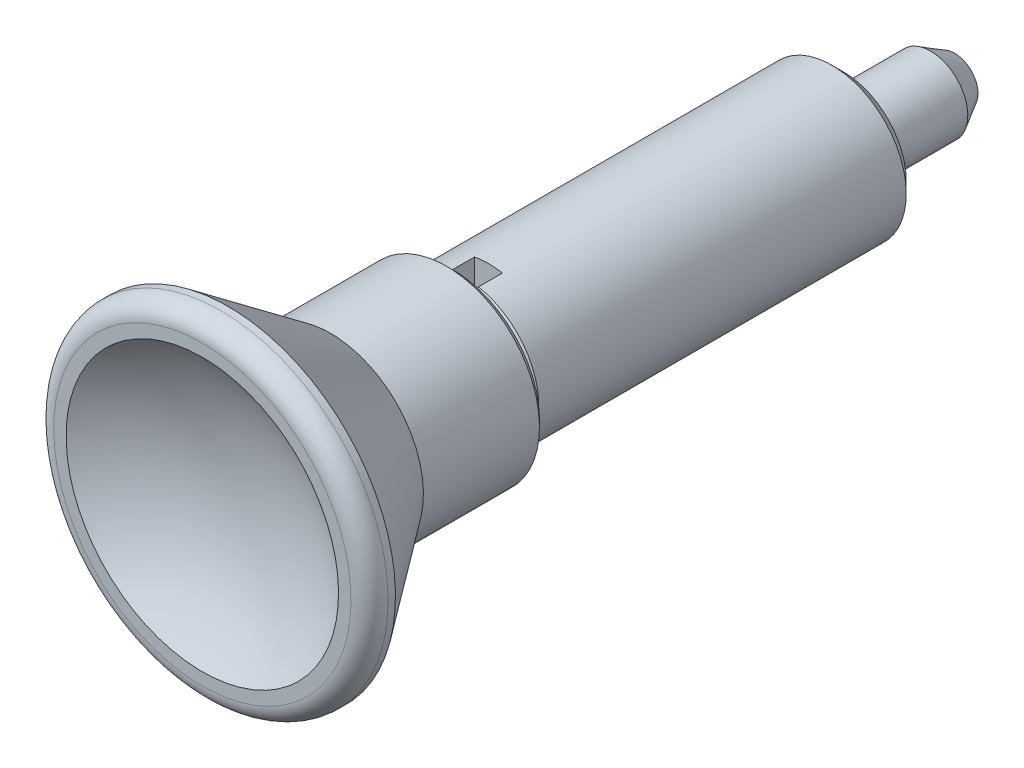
ISO-10303-21;
HEADER;
FILE_DESCRIPTION(('STEP AP214'),'2;1');
FILE_NAME('part.step','',(''),(''),'','','');
FILE_SCHEMA(('AUTOMOTIVE_DESIGN { 1 0 10303 214 1 1 1 1 }'));
ENDSEC;
DATA;
#1=APPLICATION_CONTEXT('core data for automotive mechanical design processes');
#2=APPLICATION_PROTOCOL_DEFINITION('international standard','automotive_design',2000,#1);
#3=PRODUCT_CONTEXT('',#1,'mechanical');
#4=PRODUCT('Part','Part','',(#3));
#5=PRODUCT_RELATED_PRODUCT_CATEGORY('part','',(#4));
#6=PRODUCT_DEFINITION_FORMATION('','',#4);
#7=PRODUCT_DEFINITION_CONTEXT('part definition',#1,'design');
#8=PRODUCT_DEFINITION('design','',#6,#7);
#9=PRODUCT_DEFINITION_SHAPE('','',#8);
#10=(LENGTH_UNIT() NAMED_UNIT(*) SI_UNIT(.MILLI.,.METRE.));
#11=(NAMED_UNIT(*) PLANE_ANGLE_UNIT() SI_UNIT($,.RADIAN.));
#12=(NAMED_UNIT(*) SI_UNIT($,.STERADIAN.) SOLID_ANGLE_UNIT());
#13=UNCERTAINTY_MEASURE_WITH_UNIT(LENGTH_MEASURE(1.E-05),#10,'distance_accuracy_value','');
#14=(GEOMETRIC_REPRESENTATION_CONTEXT(3) GLOBAL_UNCERTAINTY_ASSIGNED_CONTEXT((#13)) GLOBAL_UNIT_ASSIGNED_CONTEXT((#10,
#11,#12)) REPRESENTATION_CONTEXT('',''));
#15=CARTESIAN_POINT('',(0.,0.,0.));
#16=DIRECTION('',(0.,0.,1.));
#17=DIRECTION('',(1.,0.,0.));
#18=AXIS2_PLACEMENT_3D('',#15,#16,#17);
#19=CARTESIAN_POINT('',(0.75,-10.,19.1));
#20=DIRECTION('',(-1.,0.,0.));
#21=DIRECTION('',(0.,-1.,0.));
#22=AXIS2_PLACEMENT_3D('',#19,#20,#21);
#23=PLANE('',#22);
#24=DIRECTION('',(0.,0.,1.));
#25=VECTOR('',#24,1.);
#26=CARTESIAN_POINT('',(0.75,-3.92905841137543,19.1));
#27=LINE('',#26,#25);
#28=CARTESIAN_POINT('',(0.75,-3.92905841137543,19.1));
#29=VERTEX_POINT('',#28);
#30=CARTESIAN_POINT('',(0.75,-3.92905841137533,20.386499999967));
#31=VERTEX_POINT('',#30);
#32=EDGE_CURVE('E104',#29,#31,#27,.T.);
#33=ORIENTED_EDGE('',*,*,#32,.T.);
#34=CARTESIAN_POINT('',(0.75,-3.92905841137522,20.3864999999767));
#35=CARTESIAN_POINT('',(0.75,-3.8248002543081,20.4889379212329));
#36=CARTESIAN_POINT('',(0.75,-3.72045010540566,20.5912818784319));
#37=CARTESIAN_POINT('',(0.75,-3.51156580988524,20.7957818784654));
#38=CARTESIAN_POINT('',(0.75,-3.40703166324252,20.8979379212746));
#39=CARTESIAN_POINT('',(0.75,-3.30240552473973,21.0000000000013));
#40=B_SPLINE_CURVE_WITH_KNOTS('',3,(#34,#35,#36,#37,#38,#39),.UNSPECIFIED.,.F.,.F.,(4,2,4),(0.,
0.438485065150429,0.876970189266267),.UNSPECIFIED.);
#41=CARTESIAN_POINT('',(0.75,-3.30240552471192,21.0000000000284));
#42=VERTEX_POINT('',#41);
#43=EDGE_CURVE('E90',#31,#42,#40,.T.);
#44=ORIENTED_EDGE('',*,*,#43,.T.);
#45=DIRECTION('',(0.,-1.,0.));
#46=VECTOR('',#45,1.);
#47=CARTESIAN_POINT('',(0.75,-10.,21.));
#48=LINE('',#47,#46);
#49=CARTESIAN_POINT('',(0.75,-1.85404962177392,21.));
#50=VERTEX_POINT('',#49);
#51=EDGE_CURVE('E95',#42,#50,#48,.F.);
#52=ORIENTED_EDGE('',*,*,#51,.T.);
#53=DIRECTION('',(0.,0.,1.));
#54=VECTOR('',#53,1.);
#55=CARTESIAN_POINT('',(0.75,-1.85404962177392,-6.));
#56=LINE('',#55,#54);
#57=CARTESIAN_POINT('',(0.75,-1.85404962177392,19.1));
#58=VERTEX_POINT('',#57);
#59=EDGE_CURVE('E353',#58,#50,#56,.T.);
#60=ORIENTED_EDGE('',*,*,#59,.F.);
#61=DIRECTION('',(0.,-1.,0.));
#62=VECTOR('',#61,1.);
#63=CARTESIAN_POINT('',(0.75,-10.,19.1));
#64=LINE('',#63,#62);
#65=EDGE_CURVE('E345',#29,#58,#64,.F.);
#66=ORIENTED_EDGE('',*,*,#65,.F.);
#67=EDGE_LOOP('',(#33,#44,#52,#60,#66));
#68=FACE_BOUND('',#67,.T.);
#69=ADVANCED_FACE('F14',(#68),#23,.T.);
#70=CARTESIAN_POINT('',(0.75,-10.,19.1));
#71=DIRECTION('',(-1.,0.,0.));
#72=DIRECTION('',(0.,-1.,0.));
#73=AXIS2_PLACEMENT_3D('',#70,#71,#72);
#74=PLANE('',#73);
#75=CARTESIAN_POINT('',(0.750000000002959,3.3024055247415,21.0000000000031));
#76=CARTESIAN_POINT('',(0.750000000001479,3.40703166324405,20.8979379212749));
#77=CARTESIAN_POINT('',(0.750000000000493,3.51156580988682,20.7957818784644));
#78=CARTESIAN_POINT('',(0.749999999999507,3.72045010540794,20.5912818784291));
#79=CARTESIAN_POINT('',(0.749999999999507,3.82480025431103,20.4889379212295));
#80=CARTESIAN_POINT('',(0.75,3.92905841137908,20.3864999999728));
#81=B_SPLINE_CURVE_WITH_KNOTS('',3,(#75,#76,#77,#78,#79,#80),.UNSPECIFIED.,.F.,.F.,(4,2,4),(0.,
0.438485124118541,0.876970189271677),.UNSPECIFIED.);
#82=CARTESIAN_POINT('',(0.75,3.30240552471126,21.0000000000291));
#83=VERTEX_POINT('',#82);
#84=CARTESIAN_POINT('',(0.75,3.92905841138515,20.3864999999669));
#85=VERTEX_POINT('',#84);
#86=EDGE_CURVE('E109',#83,#85,#81,.T.);
#87=ORIENTED_EDGE('',*,*,#86,.T.);
#88=DIRECTION('',(0.,0.,1.));
#89=VECTOR('',#88,1.);
#90=CARTESIAN_POINT('',(0.75,3.92905841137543,19.1));
#91=LINE('',#90,#89);
#92=CARTESIAN_POINT('',(0.75,3.92905841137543,19.1));
#93=VERTEX_POINT('',#92);
#94=EDGE_CURVE('E348',#85,#93,#91,.F.);
#95=ORIENTED_EDGE('',*,*,#94,.T.);
#96=DIRECTION('',(0.,-1.,0.));
#97=VECTOR('',#96,1.);
#98=CARTESIAN_POINT('',(0.75,-10.,19.1));
#99=LINE('',#98,#97);
#100=CARTESIAN_POINT('',(0.75,1.85404962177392,19.1));
#101=VERTEX_POINT('',#100);
#102=EDGE_CURVE('E332',#101,#93,#99,.F.);
#103=ORIENTED_EDGE('',*,*,#102,.F.);
#104=DIRECTION('',(0.,0.,1.));
#105=VECTOR('',#104,1.);
#106=CARTESIAN_POINT('',(0.75,1.85404962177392,-6.));
#107=LINE('',#106,#105);
#108=CARTESIAN_POINT('',(0.75,1.85404962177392,21.));
#109=VERTEX_POINT('',#108);
#110=EDGE_CURVE('E350',#109,#101,#107,.F.);
#111=ORIENTED_EDGE('',*,*,#110,.F.);
#112=DIRECTION('',(0.,-1.,0.));
#113=VECTOR('',#112,1.);
#114=CARTESIAN_POINT('',(0.75,-10.,21.));
#115=LINE('',#114,#113);
#116=EDGE_CURVE('E115',#109,#83,#115,.F.);
#117=ORIENTED_EDGE('',*,*,#116,.T.);
#118=EDGE_LOOP('',(#87,#95,#103,#111,#117));
#119=FACE_BOUND('',#118,.T.);
#120=ADVANCED_FACE('F192',(#119),#74,.T.);
#121=CARTESIAN_POINT('',(-0.75,-10.,19.1));
#122=DIRECTION('',(0.,0.,1.));
#123=DIRECTION('',(0.,-1.,0.));
#124=AXIS2_PLACEMENT_3D('',#121,#122,#123);
#125=PLANE('',#124);
#126=DIRECTION('',(0.,1.,0.));
#127=VECTOR('',#126,1.);
#128=CARTESIAN_POINT('',(-0.75,-10.,19.1));
#129=LINE('',#128,#127);
#130=CARTESIAN_POINT('',(-0.75,-3.92905841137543,19.1));
#131=VERTEX_POINT('',#130);
#132=CARTESIAN_POINT('',(-0.75,-1.85404962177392,19.1));
#133=VERTEX_POINT('',#132);
#134=EDGE_CURVE('E342',#131,#133,#129,.T.);
#135=ORIENTED_EDGE('',*,*,#134,.F.);
#136=CARTESIAN_POINT('',(0.,0.,19.1));
#137=DIRECTION('',(0.,0.,1.));
#138=DIRECTION('',(0.,-1.,0.));
#139=AXIS2_PLACEMENT_3D('',#136,#137,#138);
#140=CIRCLE('',#139,4.);
#141=EDGE_CURVE('E347',#131,#29,#140,.T.);
#142=ORIENTED_EDGE('',*,*,#141,.T.);
#143=ORIENTED_EDGE('',*,*,#65,.T.);
#144=CARTESIAN_POINT('',(0.,0.,19.1));
#145=DIRECTION('',(0.,0.,1.));
#146=DIRECTION('',(0.,-1.,0.));
#147=AXIS2_PLACEMENT_3D('',#144,#145,#146);
#148=CIRCLE('',#147,2.);
#149=EDGE_CURVE('E354',#133,#58,#148,.T.);
#150=ORIENTED_EDGE('',*,*,#149,.F.);
#151=EDGE_LOOP('',(#135,#142,#143,#150));
#152=FACE_BOUND('',#151,.T.);
#153=ADVANCED_FACE('F189',(#152),#125,.T.);
#154=CARTESIAN_POINT('',(0.,0.,-6.));
#155=DIRECTION('',(0.,0.,1.));
#156=DIRECTION('',(0.,-1.,0.));
#157=AXIS2_PLACEMENT_3D('',#154,#155,#156);
#158=CYLINDRICAL_SURFACE('',#157,2.);
#159=ORIENTED_EDGE('',*,*,#59,.T.);
#160=CARTESIAN_POINT('',(0.,0.,21.));
#161=DIRECTION('',(0.,0.,1.));
#162=DIRECTION('',(0.,-1.,0.));
#163=AXIS2_PLACEMENT_3D('',#160,#161,#162);
#164=CIRCLE('',#163,2.);
#165=CARTESIAN_POINT('',(-0.75,-1.85404962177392,21.));
#166=VERTEX_POINT('',#165);
#167=EDGE_CURVE('E100',#50,#166,#164,.F.);
#168=ORIENTED_EDGE('',*,*,#167,.T.);
#169=DIRECTION('',(0.,0.,1.));
#170=VECTOR('',#169,1.);
#171=CARTESIAN_POINT('',(-0.75,-1.85404962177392,21.));
#172=LINE('',#171,#170);
#173=EDGE_CURVE('E338',#133,#166,#172,.T.);
#174=ORIENTED_EDGE('',*,*,#173,.F.);
#175=ORIENTED_EDGE('',*,*,#149,.T.);
#176=EDGE_LOOP('',(#159,#168,#174,#175));
#177=FACE_BOUND('',#176,.T.);
#178=ADVANCED_FACE('F185',(#177),#158,.T.);
#179=CARTESIAN_POINT('',(0.,0.,-6.));
#180=DIRECTION('',(0.,0.,1.));
#181=DIRECTION('',(0.,-1.,0.));
#182=AXIS2_PLACEMENT_3D('',#179,#180,#181);
#183=CYLINDRICAL_SURFACE('',#182,2.);
#184=ORIENTED_EDGE('',*,*,#110,.T.);
#185=CARTESIAN_POINT('',(0.,0.,19.1));
#186=DIRECTION('',(0.,0.,1.));
#187=DIRECTION('',(0.,-1.,0.));
#188=AXIS2_PLACEMENT_3D('',#185,#186,#187);
#189=CIRCLE('',#188,2.);
#190=CARTESIAN_POINT('',(-0.75,1.85404962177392,19.1));
#191=VERTEX_POINT('',#190);
#192=EDGE_CURVE('E334',#191,#101,#189,.F.);
#193=ORIENTED_EDGE('',*,*,#192,.F.);
#194=DIRECTION('',(0.,0.,1.));
#195=VECTOR('',#194,1.);
#196=CARTESIAN_POINT('',(-0.75,1.85404962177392,21.));
#197=LINE('',#196,#195);
#198=CARTESIAN_POINT('',(-0.75,1.85404962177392,21.));
#199=VERTEX_POINT('',#198);
#200=EDGE_CURVE('E331',#199,#191,#197,.F.);
#201=ORIENTED_EDGE('',*,*,#200,.F.);
#202=CARTESIAN_POINT('',(0.,0.,21.));
#203=DIRECTION('',(0.,0.,1.));
#204=DIRECTION('',(0.,-1.,0.));
#205=AXIS2_PLACEMENT_3D('',#202,#203,#204);
#206=CIRCLE('',#205,2.);
#207=EDGE_CURVE('E351',#199,#109,#206,.F.);
#208=ORIENTED_EDGE('',*,*,#207,.T.);
#209=EDGE_LOOP('',(#184,#193,#201,#208));
#210=FACE_BOUND('',#209,.T.);
#211=ADVANCED_FACE('F181',(#210),#183,.T.);
#212=CARTESIAN_POINT('',(-0.75,-10.,19.1));
#213=DIRECTION('',(0.,0.,1.));
#214=DIRECTION('',(0.,-1.,0.));
#215=AXIS2_PLACEMENT_3D('',#212,#213,#214);
#216=PLANE('',#215);
#217=ORIENTED_EDGE('',*,*,#102,.T.);
#218=CARTESIAN_POINT('',(0.,0.,19.1));
#219=DIRECTION('',(0.,0.,1.));
#220=DIRECTION('',(0.,-1.,0.));
#221=AXIS2_PLACEMENT_3D('',#218,#219,#220);
#222=CIRCLE('',#221,4.);
#223=CARTESIAN_POINT('',(-0.75,3.92905841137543,19.1));
#224=VERTEX_POINT('',#223);
#225=EDGE_CURVE('E169',#93,#224,#222,.T.);
#226=ORIENTED_EDGE('',*,*,#225,.T.);
#227=DIRECTION('',(0.,1.,0.));
#228=VECTOR('',#227,1.);
#229=CARTESIAN_POINT('',(-0.75,-10.,19.1));
#230=LINE('',#229,#228);
#231=EDGE_CURVE('E326',#191,#224,#230,.T.);
#232=ORIENTED_EDGE('',*,*,#231,.F.);
#233=ORIENTED_EDGE('',*,*,#192,.T.);
#234=EDGE_LOOP('',(#217,#226,#232,#233));
#235=FACE_BOUND('',#234,.T.);
#236=ADVANCED_FACE('F176',(#235),#216,.T.);
#237=CARTESIAN_POINT('',(-0.75,-10.,21.));
#238=DIRECTION('',(1.,0.,0.));
#239=DIRECTION('',(0.,1.,0.));
#240=AXIS2_PLACEMENT_3D('',#237,#238,#239);
#241=PLANE('',#240);
#242=CARTESIAN_POINT('',(-0.750000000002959,-3.3024055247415,21.0000000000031));
#243=CARTESIAN_POINT('',(-0.750000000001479,-3.40703166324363,20.8979379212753));
#244=CARTESIAN_POINT('',(-0.750000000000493,-3.51156580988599,20.7957818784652));
#245=CARTESIAN_POINT('',(-0.749999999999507,-3.72045010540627,20.5912818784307));
#246=CARTESIAN_POINT('',(-0.749999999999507,-3.82480025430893,20.4889379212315));
#247=CARTESIAN_POINT('',(-0.75,-3.92905841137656,20.3864999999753));
#248=B_SPLINE_CURVE_WITH_KNOTS('',3,(#242,#243,#244,#245,#246,#247),.UNSPECIFIED.,.F.,.F.,(4,2,
4),(0.,0.438485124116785,0.876970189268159),.UNSPECIFIED.);
#249=CARTESIAN_POINT('',(-0.75,-3.30240552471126,21.0000000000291));
#250=VERTEX_POINT('',#249);
#251=CARTESIAN_POINT('',(-0.75,-3.92905841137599,20.3864999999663));
#252=VERTEX_POINT('',#251);
#253=EDGE_CURVE('E161',#250,#252,#248,.T.);
#254=ORIENTED_EDGE('',*,*,#253,.T.);
#255=DIRECTION('',(0.,0.,1.));
#256=VECTOR('',#255,1.);
#257=CARTESIAN_POINT('',(-0.75,-3.92905841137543,0.));
#258=LINE('',#257,#256);
#259=EDGE_CURVE('E324',#131,#252,#258,.T.);
#260=ORIENTED_EDGE('',*,*,#259,.F.);
#261=ORIENTED_EDGE('',*,*,#134,.T.);
#262=ORIENTED_EDGE('',*,*,#173,.T.);
#263=DIRECTION('',(0.,1.,0.));
#264=VECTOR('',#263,1.);
#265=CARTESIAN_POINT('',(-0.75,-10.,21.));
#266=LINE('',#265,#264);
#267=EDGE_CURVE('E168',#166,#250,#266,.F.);
#268=ORIENTED_EDGE('',*,*,#267,.T.);
#269=EDGE_LOOP('',(#254,#260,#261,#262,#268));
#270=FACE_BOUND('',#269,.T.);
#271=ADVANCED_FACE('F171',(#270),#241,.T.);
#272=CARTESIAN_POINT('',(-0.75,-10.,21.));
#273=DIRECTION('',(1.,0.,0.));
#274=DIRECTION('',(0.,1.,0.));
#275=AXIS2_PLACEMENT_3D('',#272,#273,#274);
#276=PLANE('',#275);
#277=DIRECTION('',(0.,0.,1.));
#278=VECTOR('',#277,1.);
#279=CARTESIAN_POINT('',(-0.75,3.92905841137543,0.));
#280=LINE('',#279,#278);
#281=CARTESIAN_POINT('',(-0.75,3.92905841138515,20.3864999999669));
#282=VERTEX_POINT('',#281);
#283=EDGE_CURVE('E320',#282,#224,#280,.F.);
#284=ORIENTED_EDGE('',*,*,#283,.F.);
#285=CARTESIAN_POINT('',(-0.75,3.30240552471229,21.0000000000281));
#286=CARTESIAN_POINT('',(-0.75,3.40703166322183,20.8979379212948));
#287=CARTESIAN_POINT('',(-0.75,3.51156580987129,20.795781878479));
#288=CARTESIAN_POINT('',(-0.75,3.72045010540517,20.5912818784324));
#289=CARTESIAN_POINT('',(-0.75,3.82480025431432,20.4889379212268));
#290=CARTESIAN_POINT('',(-0.75,3.92905841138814,20.386499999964));
#291=B_SPLINE_CURVE_WITH_KNOTS('',3,(#285,#286,#287,#288,#289,#290),.UNSPECIFIED.,.F.,.F.,(4,2,
4),(0.,0.438485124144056,0.876970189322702),.UNSPECIFIED.);
#292=CARTESIAN_POINT('',(-0.75,3.30240552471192,21.0000000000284));
#293=VERTEX_POINT('',#292);
#294=EDGE_CURVE('E154',#293,#282,#291,.T.);
#295=ORIENTED_EDGE('',*,*,#294,.F.);
#296=DIRECTION('',(0.,1.,0.));
#297=VECTOR('',#296,1.);
#298=CARTESIAN_POINT('',(-0.75,-10.,21.));
#299=LINE('',#298,#297);
#300=EDGE_CURVE('E33',#293,#199,#299,.F.);
#301=ORIENTED_EDGE('',*,*,#300,.T.);
#302=ORIENTED_EDGE('',*,*,#200,.T.);
#303=ORIENTED_EDGE('',*,*,#231,.T.);
#304=EDGE_LOOP('',(#284,#295,#301,#302,#303));
#305=FACE_BOUND('',#304,.T.);
#306=ADVANCED_FACE('F175',(#305),#276,.T.);
#307=CARTESIAN_POINT('',(0.,0.,0.));
#308=DIRECTION('',(0.,0.,1.));
#309=DIRECTION('',(0.,-1.,0.));
#310=AXIS2_PLACEMENT_3D('',#307,#308,#309);
#311=CYLINDRICAL_SURFACE('',#310,4.);
#312=ORIENTED_EDGE('',*,*,#283,.T.);
#313=ORIENTED_EDGE('',*,*,#225,.F.);
#314=ORIENTED_EDGE('',*,*,#94,.F.);
#315=CARTESIAN_POINT('',(0.,0.,20.3864999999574));
#316=DIRECTION('',(0.,0.,-1.));
#317=DIRECTION('',(0.,1.,0.));
#318=AXIS2_PLACEMENT_3D('',#315,#316,#317);
#319=CIRCLE('',#318,4.0000000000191);
#320=EDGE_CURVE('E263',#31,#85,#319,.F.);
#321=ORIENTED_EDGE('',*,*,#320,.F.);
#322=ORIENTED_EDGE('',*,*,#32,.F.);
#323=ORIENTED_EDGE('',*,*,#141,.F.);
#324=ORIENTED_EDGE('',*,*,#259,.T.);
#325=CARTESIAN_POINT('',(0.,0.,20.3864999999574));
#326=DIRECTION('',(0.,0.,-1.));
#327=DIRECTION('',(0.,1.,0.));
#328=AXIS2_PLACEMENT_3D('',#325,#326,#327);
#329=CIRCLE('',#328,4.0000000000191);
#330=EDGE_CURVE('E265',#282,#252,#329,.F.);
#331=ORIENTED_EDGE('',*,*,#330,.F.);
#332=EDGE_LOOP('',(#312,#313,#314,#321,#322,#323,#324,#331));
#333=FACE_BOUND('',#332,.T.);
#334=CARTESIAN_POINT('',(0.,0.,0.6135));
#335=DIRECTION('',(0.,0.,1.));
#336=DIRECTION('',(0.,-1.,0.));
#337=AXIS2_PLACEMENT_3D('',#334,#335,#336);
#338=CIRCLE('',#337,4.);
#339=CARTESIAN_POINT('',(0.,-4.,0.6135));
#340=VERTEX_POINT('',#339);
#341=EDGE_CURVE('E105',#340,#340,#338,.T.);
#342=ORIENTED_EDGE('',*,*,#341,.T.);
#343=EDGE_LOOP('',(#342));
#344=FACE_BOUND('',#343,.T.);
#345=ADVANCED_FACE('F149',(#333,#344),#311,.T.);
#346=CARTESIAN_POINT('',(0.,0.,20.3864999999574));
#347=DIRECTION('',(0.,0.,-1.));
#348=DIRECTION('',(0.,1.,0.));
#349=AXIS2_PLACEMENT_3D('',#346,#347,#348);
#350=CONICAL_SURFACE('',#349,4.0000000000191,0.785398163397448);
#351=ORIENTED_EDGE('',*,*,#253,.F.);
#352=CARTESIAN_POINT('',(0.,0.,21.0000000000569));
#353=DIRECTION('',(0.,0.,-1.));
#354=DIRECTION('',(0.,1.,0.));
#355=AXIS2_PLACEMENT_3D('',#352,#353,#354);
#356=CIRCLE('',#355,3.38649999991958);
#357=EDGE_CURVE('E111',#250,#293,#356,.T.);
#358=ORIENTED_EDGE('',*,*,#357,.T.);
#359=ORIENTED_EDGE('',*,*,#294,.T.);
#360=ORIENTED_EDGE('',*,*,#330,.T.);
#361=EDGE_LOOP('',(#351,#358,#359,#360));
#362=FACE_BOUND('',#361,.T.);
#363=ADVANCED_FACE('F141',(#362),#350,.T.);
#364=CARTESIAN_POINT('',(0.,0.,20.3864999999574));
#365=DIRECTION('',(0.,0.,-1.));
#366=DIRECTION('',(0.,1.,0.));
#367=AXIS2_PLACEMENT_3D('',#364,#365,#366);
#368=CONICAL_SURFACE('',#367,4.0000000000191,0.785398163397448);
#369=ORIENTED_EDGE('',*,*,#43,.F.);
#370=ORIENTED_EDGE('',*,*,#320,.T.);
#371=ORIENTED_EDGE('',*,*,#86,.F.);
#372=CARTESIAN_POINT('',(0.,0.,21.0000000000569));
#373=DIRECTION('',(0.,0.,-1.));
#374=DIRECTION('',(0.,1.,0.));
#375=AXIS2_PLACEMENT_3D('',#372,#373,#374);
#376=CIRCLE('',#375,3.38649999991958);
#377=EDGE_CURVE('E97',#83,#42,#376,.T.);
#378=ORIENTED_EDGE('',*,*,#377,.T.);
#379=EDGE_LOOP('',(#369,#370,#371,#378));
#380=FACE_BOUND('',#379,.T.);
#381=ADVANCED_FACE('F107',(#380),#368,.T.);
#382=CARTESIAN_POINT('',(0.,0.,44.));
#383=DIRECTION('',(-1.,0.,0.));
#384=DIRECTION('',(0.,1.,0.));
#385=AXIS2_PLACEMENT_3D('',#382,#383,#384);
#386=SPHERICAL_SURFACE('',#385,12.);
#387=CARTESIAN_POINT('',(0.,7.33143914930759,34.5));
#388=CARTESIAN_POINT('',(-0.205979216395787,7.33144062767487,34.5));
#389=CARTESIAN_POINT('',(-0.411934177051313,7.32275500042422,34.5));
#390=CARTESIAN_POINT('',(-0.822448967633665,7.28807311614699,34.5));
#391=CARTESIAN_POINT('',(-1.02700841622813,7.26207230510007,34.5));
#392=CARTESIAN_POINT('',(-1.43338925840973,7.19290757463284,34.5));
#393=CARTESIAN_POINT('',(-1.63520804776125,7.14972837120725,34.5));
#394=CARTESIAN_POINT('',(-2.03456261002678,7.04649589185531,34.5));
#395=CARTESIAN_POINT('',(-2.2320967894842,6.98643645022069,34.5));
#396=CARTESIAN_POINT('',(-2.62123343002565,6.84993539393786,34.5));
#397=CARTESIAN_POINT('',(-2.81284076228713,6.77350766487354,34.5));
#398=CARTESIAN_POINT('',(-3.1890058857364,6.60475219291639,34.5));
#399=CARTESIAN_POINT('',(-3.37356105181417,6.51241859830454,34.5));
#400=CARTESIAN_POINT('',(-3.73412260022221,6.31258951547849,34.5));
#401=CARTESIAN_POINT('',(-3.91013419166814,6.20510342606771,34.5));
#402=CARTESIAN_POINT('',(-4.25254330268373,5.97564762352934,34.5));
#403=CARTESIAN_POINT('',(-4.418937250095,5.85367257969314,34.5));
#404=CARTESIAN_POINT('',(-4.7408149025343,5.59617198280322,34.5));
#405=CARTESIAN_POINT('',(-4.89630147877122,5.46065001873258,34.5));
#406=CARTESIAN_POINT('',(-5.19536308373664,5.17693929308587,34.5));
#407=CARTESIAN_POINT('',(-5.33893369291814,5.02874587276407,34.5));
#408=CARTESIAN_POINT('',(-5.61303290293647,4.72084015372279,34.5));
#409=CARTESIAN_POINT('',(-5.7435657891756,4.56113166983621,34.5));
#410=CARTESIAN_POINT('',(-5.99076141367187,4.23122666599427,34.5));
#411=CARTESIAN_POINT('',(-6.10741901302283,4.06102629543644,34.5));
#412=CARTESIAN_POINT('',(-6.32593592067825,3.71146912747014,34.5));
#413=CARTESIAN_POINT('',(-6.427800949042,3.53211590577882,34.5));
#414=CARTESIAN_POINT('',(-6.61609753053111,3.16539948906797,34.5));
#415=CARTESIAN_POINT('',(-6.70252337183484,2.97803336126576,34.5));
#416=CARTESIAN_POINT('',(-6.85925134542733,2.59675511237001,34.5));
#417=CARTESIAN_POINT('',(-6.92955944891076,2.40284544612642,34.5));
#418=CARTESIAN_POINT('',(-7.05361703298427,2.00972472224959,34.5));
#419=CARTESIAN_POINT('',(-7.10736039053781,1.81051173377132,34.5));
#420=CARTESIAN_POINT('',(-7.19785168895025,1.40832460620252,34.5));
#421=CARTESIAN_POINT('',(-7.23460586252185,1.20535187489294,34.5));
#422=CARTESIAN_POINT('',(-7.29090733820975,0.797013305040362,34.5));
#423=CARTESIAN_POINT('',(-7.31044828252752,0.591646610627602,34.5));
#424=CARTESIAN_POINT('',(-7.34293703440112,-0.0257030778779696,34.5));
#425=CARTESIAN_POINT('',(-7.32984889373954,-0.439373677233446,34.5));
#426=CARTESIAN_POINT('',(-7.23440515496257,-1.25842018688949,34.5));
#427=CARTESIAN_POINT('',(-7.15204953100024,-1.66379609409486,34.5));
#428=CARTESIAN_POINT('',(-6.92045134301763,-2.45502887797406,34.5));
#429=CARTESIAN_POINT('',(-6.77120870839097,-2.84088573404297,34.5));
#430=CARTESIAN_POINT('',(-6.41006162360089,-3.58205069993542,34.5));
#431=CARTESIAN_POINT('',(-6.19815719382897,-3.93735881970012,34.5));
#432=CARTESIAN_POINT('',(-5.71770502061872,-4.60736046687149,34.5));
#433=CARTESIAN_POINT('',(-5.44915730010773,-4.92205401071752,34.5));
#434=CARTESIAN_POINT('',(-4.86304090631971,-5.50188805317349,34.5));
#435=CARTESIAN_POINT('',(-4.54547222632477,-5.76702854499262,34.5));
#436=CARTESIAN_POINT('',(-3.87032895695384,-6.24023136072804,34.5));
#437=CARTESIAN_POINT('',(-3.51275436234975,-6.44829367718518,34.5));
#438=CARTESIAN_POINT('',(-2.76774974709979,-6.80143341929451,34.5));
#439=CARTESIAN_POINT('',(-2.38031972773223,-6.94651084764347,34.5));
#440=CARTESIAN_POINT('',(-1.58660228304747,-7.16956260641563,34.5));
#441=CARTESIAN_POINT('',(-1.18031485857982,-7.24753693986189,34.5));
#442=CARTESIAN_POINT('',(-0.360415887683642,-7.33416902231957,34.5));
#443=CARTESIAN_POINT('',(0.0531956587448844,-7.34282677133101,34.5));
#444=CARTESIAN_POINT('',(0.876001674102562,-7.29057995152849,34.5));
#445=CARTESIAN_POINT('',(1.28519614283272,-7.22967537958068,34.5));
#446=CARTESIAN_POINT('',(2.08755217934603,-7.04003270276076,34.5));
#447=CARTESIAN_POINT('',(2.48071374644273,-6.91129459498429,34.5));
#448=CARTESIAN_POINT('',(3.23984318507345,-6.5896397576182,34.5));
#449=CARTESIAN_POINT('',(3.60581106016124,-6.39672303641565,34.5));
#450=CARTESIAN_POINT('',(4.30016446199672,-5.95218586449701,34.5));
#451=CARTESIAN_POINT('',(4.62854999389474,-5.70056542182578,34.5));
#452=CARTESIAN_POINT('',(5.23841666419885,-5.14576893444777,34.5));
#453=CARTESIAN_POINT('',(5.51989778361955,-4.84259286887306,34.5));
#454=CARTESIAN_POINT('',(6.02796636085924,-4.19327088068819,34.5));
#455=CARTESIAN_POINT('',(6.25455380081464,-3.84712494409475,34.5));
#456=CARTESIAN_POINT('',(6.64639792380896,-3.12176625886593,34.5));
#457=CARTESIAN_POINT('',(6.81165467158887,-2.74255354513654,34.5));
#458=CARTESIAN_POINT('',(7.07616375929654,-1.96154033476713,34.5));
#459=CARTESIAN_POINT('',(7.17541612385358,-1.55973984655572,34.5));
#460=CARTESIAN_POINT('',(7.27266504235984,-0.949232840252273,34.5));
#461=CARTESIAN_POINT('',(7.29647530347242,-0.744317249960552,34.5));
#462=CARTESIAN_POINT('',(7.32675599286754,-0.333229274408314,34.5));
#463=CARTESIAN_POINT('',(7.33323281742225,-0.127057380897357,34.5));
#464=CARTESIAN_POINT('',(7.32879308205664,0.285160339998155,34.5));
#465=CARTESIAN_POINT('',(7.31787013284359,0.491206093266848,34.5));
#466=CARTESIAN_POINT('',(7.2787105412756,0.90157265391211,34.5));
#467=CARTESIAN_POINT('',(7.25048029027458,1.10589406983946,34.5));
#468=CARTESIAN_POINT('',(7.17689678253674,1.51150746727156,34.5));
#469=CARTESIAN_POINT('',(7.13153717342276,1.71279829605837,34.5));
#470=CARTESIAN_POINT('',(7.02403888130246,2.11076896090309,34.5));
#471=CARTESIAN_POINT('',(6.96190639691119,2.30745047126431,34.5));
#472=CARTESIAN_POINT('',(6.82126899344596,2.69495656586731,34.5));
#473=CARTESIAN_POINT('',(6.74275773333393,2.88577884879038,34.5));
#474=CARTESIAN_POINT('',(6.56996778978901,3.26006032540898,34.5));
#475=CARTESIAN_POINT('',(6.47569493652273,3.44352221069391,34.5));
#476=CARTESIAN_POINT('',(6.27199785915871,3.80191279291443,34.5));
#477=CARTESIAN_POINT('',(6.1625686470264,3.97683865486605,34.5));
#478=CARTESIAN_POINT('',(5.92940387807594,4.31678543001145,34.5));
#479=CARTESIAN_POINT('',(5.80567361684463,4.48180997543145,34.5));
#480=CARTESIAN_POINT('',(5.54471896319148,4.80089374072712,34.5));
#481=CARTESIAN_POINT('',(5.40749101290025,4.95495005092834,34.5));
#482=CARTESIAN_POINT('',(5.12059718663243,5.25089919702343,34.5));
#483=CARTESIAN_POINT('',(4.97093591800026,5.39279649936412,34.5));
#484=CARTESIAN_POINT('',(4.66009879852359,5.66356684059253,34.5));
#485=CARTESIAN_POINT('',(4.49891588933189,5.79243177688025,34.5));
#486=CARTESIAN_POINT('',(4.16632566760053,6.0360756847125,34.5));
#487=CARTESIAN_POINT('',(3.99492214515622,6.15085983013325,34.5));
#488=CARTESIAN_POINT('',(3.6429059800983,6.36567249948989,34.5));
#489=CARTESIAN_POINT('',(3.46228567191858,6.46568846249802,34.5));
#490=CARTESIAN_POINT('',(3.09332440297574,6.65010265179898,34.5));
#491=CARTESIAN_POINT('',(2.90498628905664,6.73450657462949,34.5));
#492=CARTESIAN_POINT('',(2.52203405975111,6.88707373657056,34.5));
#493=CARTESIAN_POINT('',(2.32742568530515,6.95525137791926,34.5));
#494=CARTESIAN_POINT('',(1.93322420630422,7.07496111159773,34.5));
#495=CARTESIAN_POINT('',(1.73363242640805,7.12649757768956,34.5));
#496=CARTESIAN_POINT('',(1.2806433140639,7.2233023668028,34.5));
#497=CARTESIAN_POINT('',(1.02621667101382,7.26381924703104,34.5));
#498=CARTESIAN_POINT('',(0.514514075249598,7.31788671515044,34.5));
#499=CARTESIAN_POINT('',(0.25723812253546,7.33143730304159,34.5));
#500=CARTESIAN_POINT('',(0.,7.33143914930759,34.5));
#501=B_SPLINE_CURVE_WITH_KNOTS('',3,(#387,#388,#389,#390,#391,#392,#393,#394,#395,#396,#397,
#398,#399,#400,#401,#402,#403,#404,#405,#406,#407,#408,#409,#410,#411,#412,#413,#414,#415,#416,
#417,#418,#419,#420,#421,#422,#423,#424,#425,#426,#427,#428,#429,#430,#431,#432,#433,#434,#435,
#436,#437,#438,#439,#440,#441,#442,#443,#444,#445,#446,#447,#448,#449,#450,#451,#452,#453,#454,
#455,#456,#457,#458,#459,#460,#461,#462,#463,#464,#465,#466,#467,#468,#469,#470,#471,#472,#473,
#474,#475,#476,#477,#478,#479,#480,#481,#482,#483,#484,#485,#486,#487,#488,#489,#490,#491,#492,
#493,#494,#495,#496,#497,#498,#499,#500),.UNSPECIFIED.,.T.,.F.,(4,2,2,2,2,2,2,2,2,2,2,2,2,2,2,2,
2,2,2,2,2,2,2,2,2,2,2,2,2,2,2,2,2,2,2,2,2,2,2,2,2,2,2,2,2,2,2,2,2,2,2,2,2,2,2,2,4),(0.,
0.61771295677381,1.2355884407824,1.85401489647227,2.47266753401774,3.09079741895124,
3.7091551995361,4.32713109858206,4.94533506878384,5.56337569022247,6.18164452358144,
6.7997094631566,7.41800260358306,8.03605601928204,8.65433761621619,9.27238978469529,
9.89067013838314,10.5087234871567,11.1270050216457,12.3622384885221,13.5974724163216,
14.8327076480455,16.067942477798,17.3031768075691,18.5384113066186,19.7736459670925,
21.0088805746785,22.244115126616,23.4793496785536,24.7145842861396,25.9498189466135,
27.1850534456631,28.4202877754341,29.6555226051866,30.8907578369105,32.1259917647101,
33.3612252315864,33.9795067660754,34.597560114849,35.2158404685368,35.8338926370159,
36.4521742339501,37.070227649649,37.6885207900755,38.3065857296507,38.9248545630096,
39.5428951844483,40.16109915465,40.779075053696,41.3974328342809,42.0155627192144,
42.6342153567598,43.2526418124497,43.8705172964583,44.4882302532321,45.2596640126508,
46.0310977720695),.UNSPECIFIED.);
#502=CARTESIAN_POINT('',(0.,7.33143914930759,34.5));
#503=VERTEX_POINT('',#502);
#504=EDGE_CURVE('E110',#503,#503,#501,.T.);
#505=ORIENTED_EDGE('',*,*,#504,.T.);
#506=EDGE_LOOP('',(#505));
#507=FACE_BOUND('',#506,.T.);
#508=ADVANCED_FACE('F140',(#507),#386,.F.);
#509=CARTESIAN_POINT('',(4.64644660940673,0.,21.));
#510=DIRECTION('',(0.,0.,1.));
#511=DIRECTION('',(0.,-1.,0.));
#512=AXIS2_PLACEMENT_3D('',#509,#510,#511);
#513=PLANE('',#512);
#514=CARTESIAN_POINT('',(0.,0.,21.));
#515=DIRECTION('',(0.,0.,1.));
#516=DIRECTION('',(0.,-1.,0.));
#517=AXIS2_PLACEMENT_3D('',#514,#515,#516);
#518=CIRCLE('',#517,4.64644660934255);
#519=CARTESIAN_POINT('',(0.,-4.64644660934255,21.));
#520=VERTEX_POINT('',#519);
#521=EDGE_CURVE('E260',#520,#520,#518,.T.);
#522=ORIENTED_EDGE('',*,*,#521,.F.);
#523=EDGE_LOOP('',(#522));
#524=FACE_BOUND('',#523,.T.);
#525=ORIENTED_EDGE('',*,*,#116,.F.);
#526=ORIENTED_EDGE('',*,*,#207,.F.);
#527=ORIENTED_EDGE('',*,*,#300,.F.);
#528=ORIENTED_EDGE('',*,*,#357,.F.);
#529=ORIENTED_EDGE('',*,*,#267,.F.);
#530=ORIENTED_EDGE('',*,*,#167,.F.);
#531=ORIENTED_EDGE('',*,*,#51,.F.);
#532=ORIENTED_EDGE('',*,*,#377,.F.);
#533=EDGE_LOOP('',(#525,#526,#527,#528,#529,#530,#531,#532));
#534=FACE_BOUND('',#533,.T.);
#535=ADVANCED_FACE('F96',(#524,#534),#513,.F.);
#536=CARTESIAN_POINT('',(7.33143914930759,0.,34.5));
#537=DIRECTION('',(0.,0.,-1.));
#538=DIRECTION('',(0.,1.,0.));
#539=AXIS2_PLACEMENT_3D('',#536,#537,#538);
#540=PLANE('',#539);
#541=ORIENTED_EDGE('',*,*,#504,.F.);
#542=EDGE_LOOP('',(#541));
#543=FACE_BOUND('',#542,.T.);
#544=CARTESIAN_POINT('',(0.,0.,34.5));
#545=DIRECTION('',(0.,0.,-1.));
#546=DIRECTION('',(0.,1.,0.));
#547=AXIS2_PLACEMENT_3D('',#544,#545,#546);
#548=CIRCLE('',#547,8.);
#549=CARTESIAN_POINT('',(0.,8.,34.5));
#550=VERTEX_POINT('',#549);
#551=EDGE_CURVE('E240',#550,#550,#548,.T.);
#552=ORIENTED_EDGE('',*,*,#551,.F.);
#553=EDGE_LOOP('',(#552));
#554=FACE_BOUND('',#553,.T.);
#555=ADVANCED_FACE('F244',(#543,#554),#540,.F.);
#556=CARTESIAN_POINT('',(0.,0.,21.353553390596));
#557=DIRECTION('',(0.,0.,1.));
#558=DIRECTION('',(0.,-1.,0.));
#559=AXIS2_PLACEMENT_3D('',#556,#557,#558);
#560=CONICAL_SURFACE('',#559,4.99999999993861,0.785398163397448);
#561=CARTESIAN_POINT('',(0.,0.,21.3535533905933));
#562=DIRECTION('',(0.,0.,1.));
#563=DIRECTION('',(0.,-1.,0.));
#564=AXIS2_PLACEMENT_3D('',#561,#562,#563);
#565=CIRCLE('',#564,5.);
#566=CARTESIAN_POINT('',(0.,-5.,21.3535533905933));
#567=VERTEX_POINT('',#566);
#568=EDGE_CURVE('E512',#567,#567,#565,.T.);
#569=ORIENTED_EDGE('',*,*,#568,.F.);
#570=EDGE_LOOP('',(#569));
#571=FACE_BOUND('',#570,.T.);
#572=ORIENTED_EDGE('',*,*,#521,.T.);
#573=EDGE_LOOP('',(#572));
#574=FACE_BOUND('',#573,.T.);
#575=ADVANCED_FACE('F227',(#571,#574),#560,.T.);
#576=CARTESIAN_POINT('',(0.,0.,33.5));
#577=DIRECTION('',(0.,0.,-1.));
#578=DIRECTION('',(0.,1.,0.));
#579=AXIS2_PLACEMENT_3D('',#576,#577,#578);
#580=TOROIDAL_SURFACE('',#579,8.,1.);
#581=CARTESIAN_POINT('',(0.,0.,33.5));
#582=DIRECTION('',(0.,0.,1.));
#583=DIRECTION('',(0.,-1.,0.));
#584=AXIS2_PLACEMENT_3D('',#581,#582,#583);
#585=CIRCLE('',#584,9.);
#586=CARTESIAN_POINT('',(0.,-9.,33.5));
#587=VERTEX_POINT('',#586);
#588=EDGE_CURVE('E516',#587,#587,#585,.F.);
#589=ORIENTED_EDGE('',*,*,#588,.F.);
#590=EDGE_LOOP('',(#589));
#591=FACE_BOUND('',#590,.T.);
#592=ORIENTED_EDGE('',*,*,#551,.T.);
#593=EDGE_LOOP('',(#592));
#594=FACE_BOUND('',#593,.T.);
#595=ADVANCED_FACE('F221',(#591,#594),#580,.T.);
#596=CARTESIAN_POINT('',(0.,0.,-6.));
#597=DIRECTION('',(0.,0.,1.));
#598=DIRECTION('',(0.,-1.,0.));
#599=AXIS2_PLACEMENT_3D('',#596,#597,#598);
#600=CYLINDRICAL_SURFACE('',#599,5.);
#601=CARTESIAN_POINT('',(0.,0.,27.6));
#602=DIRECTION('',(0.,0.,1.));
#603=DIRECTION('',(0.,-1.,0.));
#604=AXIS2_PLACEMENT_3D('',#601,#602,#603);
#605=CIRCLE('',#604,5.);
#606=CARTESIAN_POINT('',(0.,-5.,27.6));
#607=VERTEX_POINT('',#606);
#608=EDGE_CURVE('E24',#607,#607,#605,.T.);
#609=ORIENTED_EDGE('',*,*,#608,.F.);
#610=EDGE_LOOP('',(#609));
#611=FACE_BOUND('',#610,.T.);
#612=ORIENTED_EDGE('',*,*,#568,.T.);
#613=EDGE_LOOP('',(#612));
#614=FACE_BOUND('',#613,.T.);
#615=ADVANCED_FACE('F214',(#611,#614),#600,.T.);
#616=CARTESIAN_POINT('',(0.,0.,-6.));
#617=DIRECTION('',(0.,0.,1.));
#618=DIRECTION('',(0.,-1.,0.));
#619=AXIS2_PLACEMENT_3D('',#616,#617,#618);
#620=CYLINDRICAL_SURFACE('',#619,9.);
#621=ORIENTED_EDGE('',*,*,#588,.T.);
#622=EDGE_LOOP('',(#621));
#623=FACE_BOUND('',#622,.T.);
#624=CARTESIAN_POINT('',(0.,0.,33.1055276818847));
#625=DIRECTION('',(0.,0.,1.));
#626=DIRECTION('',(0.,-1.,0.));
#627=AXIS2_PLACEMENT_3D('',#624,#625,#626);
#628=CIRCLE('',#627,9.);
#629=CARTESIAN_POINT('',(0.,-9.,33.1055276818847));
#630=VERTEX_POINT('',#629);
#631=EDGE_CURVE('E9',#630,#630,#628,.F.);
#632=ORIENTED_EDGE('',*,*,#631,.F.);
#633=EDGE_LOOP('',(#632));
#634=FACE_BOUND('',#633,.T.);
#635=ADVANCED_FACE('F204',(#623,#634),#620,.T.);
#636=CARTESIAN_POINT('',(0.,0.,33.1055276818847));
#637=DIRECTION('',(0.,0.,1.));
#638=DIRECTION('',(-1.,0.,0.));
#639=AXIS2_PLACEMENT_3D('',#636,#637,#638);
#640=CONICAL_SURFACE('',#639,9.,0.628318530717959);
#641=ORIENTED_EDGE('',*,*,#631,.T.);
#642=EDGE_LOOP('',(#641));
#643=FACE_BOUND('',#642,.T.);
#644=ORIENTED_EDGE('',*,*,#608,.T.);
#645=EDGE_LOOP('',(#644));
#646=FACE_BOUND('',#645,.T.);
#647=ADVANCED_FACE('F202',(#643,#646),#640,.T.);
#648=CARTESIAN_POINT('',(1.24944465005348,0.,-6.));
#649=DIRECTION('',(0.,0.,1.));
#650=DIRECTION('',(0.,-1.,0.));
#651=AXIS2_PLACEMENT_3D('',#648,#649,#650);
#652=PLANE('',#651);
#653=CARTESIAN_POINT('',(0.,0.,-6.00000000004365));
#654=DIRECTION('',(0.,0.,1.));
#655=DIRECTION('',(0.,-1.,0.));
#656=AXIS2_PLACEMENT_3D('',#653,#654,#655);
#657=CIRCLE('',#656,1.24944465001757);
#658=CARTESIAN_POINT('',(0.,-1.24944465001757,-6.00000000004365));
#659=VERTEX_POINT('',#658);
#660=EDGE_CURVE('E18',#659,#659,#657,.T.);
#661=ORIENTED_EDGE('',*,*,#660,.F.);
#662=EDGE_LOOP('',(#661));
#663=FACE_BOUND('',#662,.T.);
#664=ADVANCED_FACE('F16',(#663),#652,.F.);
#665=CARTESIAN_POINT('',(0.,0.,-4.70000000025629));
#666=DIRECTION('',(0.,0.,1.));
#667=DIRECTION('',(0.,-1.,0.));
#668=AXIS2_PLACEMENT_3D('',#665,#666,#667);
#669=CONICAL_SURFACE('',#668,1.99999999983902,0.523598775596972);
#670=CARTESIAN_POINT('',(0.,0.,-4.7));
#671=DIRECTION('',(0.,0.,1.));
#672=DIRECTION('',(0.,-1.,0.));
#673=AXIS2_PLACEMENT_3D('',#670,#671,#672);
#674=CIRCLE('',#673,2.);
#675=CARTESIAN_POINT('',(0.,-2.,-4.7));
#676=VERTEX_POINT('',#675);
#677=EDGE_CURVE('E274',#676,#676,#674,.T.);
#678=ORIENTED_EDGE('',*,*,#677,.F.);
#679=EDGE_LOOP('',(#678));
#680=FACE_BOUND('',#679,.T.);
#681=ORIENTED_EDGE('',*,*,#660,.T.);
#682=EDGE_LOOP('',(#681));
#683=FACE_BOUND('',#682,.T.);
#684=ADVANCED_FACE('F212',(#680,#683),#669,.T.);
#685=CARTESIAN_POINT('',(0.,0.,-6.));
#686=DIRECTION('',(0.,0.,1.));
#687=DIRECTION('',(0.,-1.,0.));
#688=AXIS2_PLACEMENT_3D('',#685,#686,#687);
#689=CYLINDRICAL_SURFACE('',#688,2.);
#690=CARTESIAN_POINT('',(0.,0.,0.));
#691=DIRECTION('',(0.,0.,1.));
#692=DIRECTION('',(0.,-1.,0.));
#693=AXIS2_PLACEMENT_3D('',#690,#691,#692);
#694=CIRCLE('',#693,2.);
#695=CARTESIAN_POINT('',(0.,-2.,0.));
#696=VERTEX_POINT('',#695);
#697=EDGE_CURVE('E276',#696,#696,#694,.F.);
#698=ORIENTED_EDGE('',*,*,#697,.T.);
#699=EDGE_LOOP('',(#698));
#700=FACE_BOUND('',#699,.T.);
#701=ORIENTED_EDGE('',*,*,#677,.T.);
#702=EDGE_LOOP('',(#701));
#703=FACE_BOUND('',#702,.T.);
#704=ADVANCED_FACE('F285',(#700,#703),#689,.T.);
#705=CARTESIAN_POINT('',(3.3865,0.,0.));
#706=DIRECTION('',(0.,0.,1.));
#707=DIRECTION('',(0.,-1.,0.));
#708=AXIS2_PLACEMENT_3D('',#705,#706,#707);
#709=PLANE('',#708);
#710=CARTESIAN_POINT('',(0.,0.,9.86814796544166E-11));
#711=DIRECTION('',(0.,0.,1.));
#712=DIRECTION('',(0.,-1.,0.));
#713=AXIS2_PLACEMENT_3D('',#710,#711,#712);
#714=CIRCLE('',#713,3.38650000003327);
#715=CARTESIAN_POINT('',(0.,-3.38650000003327,9.86814796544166E-11));
#716=VERTEX_POINT('',#715);
#717=EDGE_CURVE('E133',#716,#716,#714,.T.);
#718=ORIENTED_EDGE('',*,*,#717,.F.);
#719=EDGE_LOOP('',(#718));
#720=FACE_BOUND('',#719,.T.);
#721=ORIENTED_EDGE('',*,*,#697,.F.);
#722=EDGE_LOOP('',(#721));
#723=FACE_BOUND('',#722,.T.);
#724=ADVANCED_FACE('F291',(#720,#723),#709,.F.);
#725=CARTESIAN_POINT('',(0.,0.,0.613499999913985));
#726=DIRECTION('',(0.,0.,1.));
#727=DIRECTION('',(0.,-1.,0.));
#728=AXIS2_PLACEMENT_3D('',#725,#726,#727);
#729=CONICAL_SURFACE('',#728,3.99999999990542,0.785398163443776);
#730=ORIENTED_EDGE('',*,*,#341,.F.);
#731=EDGE_LOOP('',(#730));
#732=FACE_BOUND('',#731,.T.);
#733=ORIENTED_EDGE('',*,*,#717,.T.);
#734=EDGE_LOOP('',(#733));
#735=FACE_BOUND('',#734,.T.);
#736=ADVANCED_FACE('F296',(#732,#735),#729,.T.);
#737=CLOSED_SHELL('',(#69,#120,#153,#178,#211,#236,#271,#306,#345,#363,#381,#508,#535,#555,#575,
#595,#615,#635,#647,#664,#684,#704,#724,#736));
#738=MANIFOLD_SOLID_BREP('B1',#737);
#739=ADVANCED_BREP_SHAPE_REPRESENTATION('',(#18,#738),#14);
#740=SHAPE_DEFINITION_REPRESENTATION(#9,#739);
ENDSEC;
END-ISO-10303-21;
